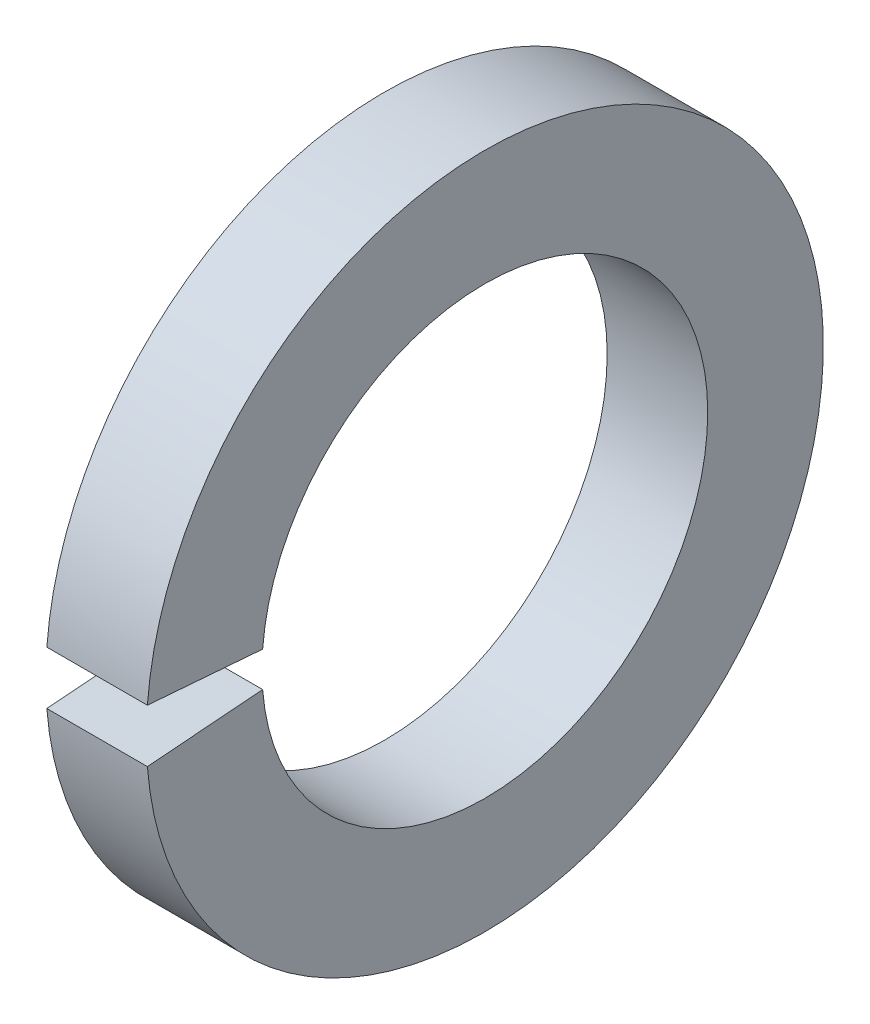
ISO-10303-21;
HEADER;
FILE_DESCRIPTION(('STEP AP214'),'2;1');
FILE_NAME('part.step','',(''),(''),'','','');
FILE_SCHEMA(('AUTOMOTIVE_DESIGN { 1 0 10303 214 1 1 1 1 }'));
ENDSEC;
DATA;
#1=APPLICATION_CONTEXT('core data for automotive mechanical design processes');
#2=APPLICATION_PROTOCOL_DEFINITION('international standard','automotive_design',2000,#1);
#3=PRODUCT_CONTEXT('',#1,'mechanical');
#4=PRODUCT('Part','Part','',(#3));
#5=PRODUCT_RELATED_PRODUCT_CATEGORY('part','',(#4));
#6=PRODUCT_DEFINITION_FORMATION('','',#4);
#7=PRODUCT_DEFINITION_CONTEXT('part definition',#1,'design');
#8=PRODUCT_DEFINITION('design','',#6,#7);
#9=PRODUCT_DEFINITION_SHAPE('','',#8);
#10=(LENGTH_UNIT() NAMED_UNIT(*) SI_UNIT(.MILLI.,.METRE.));
#11=(NAMED_UNIT(*) PLANE_ANGLE_UNIT() SI_UNIT($,.RADIAN.));
#12=(NAMED_UNIT(*) SI_UNIT($,.STERADIAN.) SOLID_ANGLE_UNIT());
#13=UNCERTAINTY_MEASURE_WITH_UNIT(LENGTH_MEASURE(1.E-05),#10,'distance_accuracy_value','');
#14=(GEOMETRIC_REPRESENTATION_CONTEXT(3) GLOBAL_UNCERTAINTY_ASSIGNED_CONTEXT((#13)) GLOBAL_UNIT_ASSIGNED_CONTEXT((#10,
#11,#12)) REPRESENTATION_CONTEXT('',''));
#15=CARTESIAN_POINT('',(0.,0.,0.));
#16=DIRECTION('',(0.,0.,1.));
#17=DIRECTION('',(1.,0.,0.));
#18=AXIS2_PLACEMENT_3D('',#15,#16,#17);
#19=CARTESIAN_POINT('',(-34.9249999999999,0.,0.));
#20=DIRECTION('',(-1.,0.,0.));
#21=DIRECTION('',(0.,0.,1.));
#22=AXIS2_PLACEMENT_3D('',#19,#20,#21);
#23=CYLINDRICAL_SURFACE('',#22,1.6891);
#24=CARTESIAN_POINT('',(0.,0.,0.));
#25=DIRECTION('',(-1.,0.,0.));
#26=DIRECTION('',(0.,0.,1.));
#27=AXIS2_PLACEMENT_3D('',#24,#25,#26);
#28=CIRCLE('',#27,1.6891);
#29=CARTESIAN_POINT('',(0.,0.132525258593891,1.6838930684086));
#30=VERTEX_POINT('',#29);
#31=CARTESIAN_POINT('',(0.,-0.132525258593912,1.68389306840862));
#32=VERTEX_POINT('',#31);
#33=EDGE_CURVE('E83',#30,#32,#28,.T.);
#34=ORIENTED_EDGE('',*,*,#33,.F.);
#35=DIRECTION('',(-1.,0.,0.));
#36=VECTOR('',#35,1.);
#37=CARTESIAN_POINT('',(-34.9249999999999,0.132525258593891,1.6838930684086));
#38=LINE('',#37,#36);
#39=CARTESIAN_POINT('',(-0.762,0.132525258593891,1.6838930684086));
#40=VERTEX_POINT('',#39);
#41=EDGE_CURVE('E97',#30,#40,#38,.T.);
#42=ORIENTED_EDGE('',*,*,#41,.T.);
#43=CARTESIAN_POINT('',(-0.761999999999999,0.,0.));
#44=DIRECTION('',(-1.,0.,0.));
#45=DIRECTION('',(0.,0.,1.));
#46=AXIS2_PLACEMENT_3D('',#43,#44,#45);
#47=CIRCLE('',#46,1.6891);
#48=CARTESIAN_POINT('',(-0.761999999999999,-0.132525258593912,1.68389306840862));
#49=VERTEX_POINT('',#48);
#50=EDGE_CURVE('E85',#40,#49,#47,.T.);
#51=ORIENTED_EDGE('',*,*,#50,.T.);
#52=DIRECTION('',(-1.,0.,0.));
#53=VECTOR('',#52,1.);
#54=CARTESIAN_POINT('',(-34.9249999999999,-0.132525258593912,1.68389306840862));
#55=LINE('',#54,#53);
#56=EDGE_CURVE('E53',#32,#49,#55,.T.);
#57=ORIENTED_EDGE('',*,*,#56,.F.);
#58=EDGE_LOOP('',(#34,#42,#51,#57));
#59=FACE_BOUND('',#58,.T.);
#60=ADVANCED_FACE('F32',(#59),#23,.F.);
#61=CARTESIAN_POINT('',(0.,1.68910000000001,0.));
#62=DIRECTION('',(-1.,0.,0.));
#63=DIRECTION('',(0.,0.,1.));
#64=AXIS2_PLACEMENT_3D('',#61,#62,#63);
#65=PLANE('',#64);
#66=CARTESIAN_POINT('',(0.,0.,0.));
#67=DIRECTION('',(-1.,0.,0.));
#68=DIRECTION('',(0.,0.,1.));
#69=AXIS2_PLACEMENT_3D('',#66,#67,#68);
#70=CIRCLE('',#69,2.5654);
#71=CARTESIAN_POINT('',(0.,0.201278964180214,2.55749172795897));
#72=VERTEX_POINT('',#71);
#73=CARTESIAN_POINT('',(0.,-0.201278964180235,2.55749172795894));
#74=VERTEX_POINT('',#73);
#75=EDGE_CURVE('E89',#72,#74,#70,.T.);
#76=ORIENTED_EDGE('',*,*,#75,.F.);
#77=DIRECTION('',(0.,0.078459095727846,0.996917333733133));
#78=VECTOR('',#77,1.);
#79=CARTESIAN_POINT('',(0.,0.,0.));
#80=LINE('',#79,#78);
#81=EDGE_CURVE('E77',#30,#72,#80,.T.);
#82=ORIENTED_EDGE('',*,*,#81,.F.);
#83=ORIENTED_EDGE('',*,*,#33,.T.);
#84=DIRECTION('',(0.,-0.0784590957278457,0.996917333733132));
#85=VECTOR('',#84,1.);
#86=CARTESIAN_POINT('',(0.,0.,0.));
#87=LINE('',#86,#85);
#88=EDGE_CURVE('E69',#32,#74,#87,.T.);
#89=ORIENTED_EDGE('',*,*,#88,.T.);
#90=EDGE_LOOP('',(#76,#82,#83,#89));
#91=FACE_BOUND('',#90,.T.);
#92=ADVANCED_FACE('F88',(#91),#65,.F.);
#93=CARTESIAN_POINT('',(-34.9249999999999,0.,0.));
#94=DIRECTION('',(-1.,0.,0.));
#95=DIRECTION('',(0.,0.,1.));
#96=AXIS2_PLACEMENT_3D('',#93,#94,#95);
#97=CYLINDRICAL_SURFACE('',#96,2.5654);
#98=CARTESIAN_POINT('',(-0.761999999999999,0.,0.));
#99=DIRECTION('',(-1.,0.,0.));
#100=DIRECTION('',(0.,0.,1.));
#101=AXIS2_PLACEMENT_3D('',#98,#99,#100);
#102=CIRCLE('',#101,2.5654);
#103=CARTESIAN_POINT('',(-0.761999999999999,0.201278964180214,2.55749172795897));
#104=VERTEX_POINT('',#103);
#105=CARTESIAN_POINT('',(-0.762,-0.201278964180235,2.55749172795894));
#106=VERTEX_POINT('',#105);
#107=EDGE_CURVE('E91',#104,#106,#102,.T.);
#108=ORIENTED_EDGE('',*,*,#107,.F.);
#109=DIRECTION('',(-1.,0.,0.));
#110=VECTOR('',#109,1.);
#111=CARTESIAN_POINT('',(-34.9249999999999,0.201278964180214,2.55749172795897));
#112=LINE('',#111,#110);
#113=EDGE_CURVE('E46',#104,#72,#112,.F.);
#114=ORIENTED_EDGE('',*,*,#113,.T.);
#115=ORIENTED_EDGE('',*,*,#75,.T.);
#116=DIRECTION('',(-1.,0.,0.));
#117=VECTOR('',#116,1.);
#118=CARTESIAN_POINT('',(-34.9249999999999,-0.201278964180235,2.55749172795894));
#119=LINE('',#118,#117);
#120=EDGE_CURVE('E72',#106,#74,#119,.F.);
#121=ORIENTED_EDGE('',*,*,#120,.F.);
#122=EDGE_LOOP('',(#108,#114,#115,#121));
#123=FACE_BOUND('',#122,.T.);
#124=ADVANCED_FACE('F104',(#123),#97,.T.);
#125=CARTESIAN_POINT('',(-0.762,2.5654,0.));
#126=DIRECTION('',(1.,0.,0.));
#127=DIRECTION('',(0.,0.,-1.));
#128=AXIS2_PLACEMENT_3D('',#125,#126,#127);
#129=PLANE('',#128);
#130=ORIENTED_EDGE('',*,*,#50,.F.);
#131=DIRECTION('',(0.,0.0784590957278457,0.996917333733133));
#132=VECTOR('',#131,1.);
#133=CARTESIAN_POINT('',(-0.762,0.0157921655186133,0.200658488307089));
#134=LINE('',#133,#132);
#135=EDGE_CURVE('E11',#40,#104,#134,.T.);
#136=ORIENTED_EDGE('',*,*,#135,.T.);
#137=ORIENTED_EDGE('',*,*,#107,.T.);
#138=DIRECTION('',(0.,-0.0784590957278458,0.996917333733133));
#139=VECTOR('',#138,1.);
#140=CARTESIAN_POINT('',(-0.762,0.0157921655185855,-0.200658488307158));
#141=LINE('',#140,#139);
#142=EDGE_CURVE('E39',#49,#106,#141,.T.);
#143=ORIENTED_EDGE('',*,*,#142,.F.);
#144=EDGE_LOOP('',(#130,#136,#137,#143));
#145=FACE_BOUND('',#144,.T.);
#146=ADVANCED_FACE('F106',(#145),#129,.F.);
#147=CARTESIAN_POINT('',(-0.762,0.,0.));
#148=DIRECTION('',(0.,0.996917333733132,0.0784590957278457));
#149=DIRECTION('',(0.,-0.0784590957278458,0.996917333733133));
#150=AXIS2_PLACEMENT_3D('',#147,#148,#149);
#151=PLANE('',#150);
#152=ORIENTED_EDGE('',*,*,#56,.T.);
#153=ORIENTED_EDGE('',*,*,#142,.T.);
#154=ORIENTED_EDGE('',*,*,#120,.T.);
#155=ORIENTED_EDGE('',*,*,#88,.F.);
#156=EDGE_LOOP('',(#152,#153,#154,#155));
#157=FACE_BOUND('',#156,.T.);
#158=ADVANCED_FACE('F70',(#157),#151,.T.);
#159=CARTESIAN_POINT('',(-0.762,0.,0.));
#160=DIRECTION('',(0.,0.996917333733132,-0.078459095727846));
#161=DIRECTION('',(0.,0.0784590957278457,0.996917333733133));
#162=AXIS2_PLACEMENT_3D('',#159,#160,#161);
#163=PLANE('',#162);
#164=ORIENTED_EDGE('',*,*,#81,.T.);
#165=ORIENTED_EDGE('',*,*,#113,.F.);
#166=ORIENTED_EDGE('',*,*,#135,.F.);
#167=ORIENTED_EDGE('',*,*,#41,.F.);
#168=EDGE_LOOP('',(#164,#165,#166,#167));
#169=FACE_BOUND('',#168,.T.);
#170=ADVANCED_FACE('F101',(#169),#163,.F.);
#171=CLOSED_SHELL('',(#60,#92,#124,#146,#158,#170));
#172=MANIFOLD_SOLID_BREP('B2',#171);
#173=ADVANCED_BREP_SHAPE_REPRESENTATION('',(#18,#172),#14);
#174=SHAPE_DEFINITION_REPRESENTATION(#9,#173);
ENDSEC;
END-ISO-10303-21;
